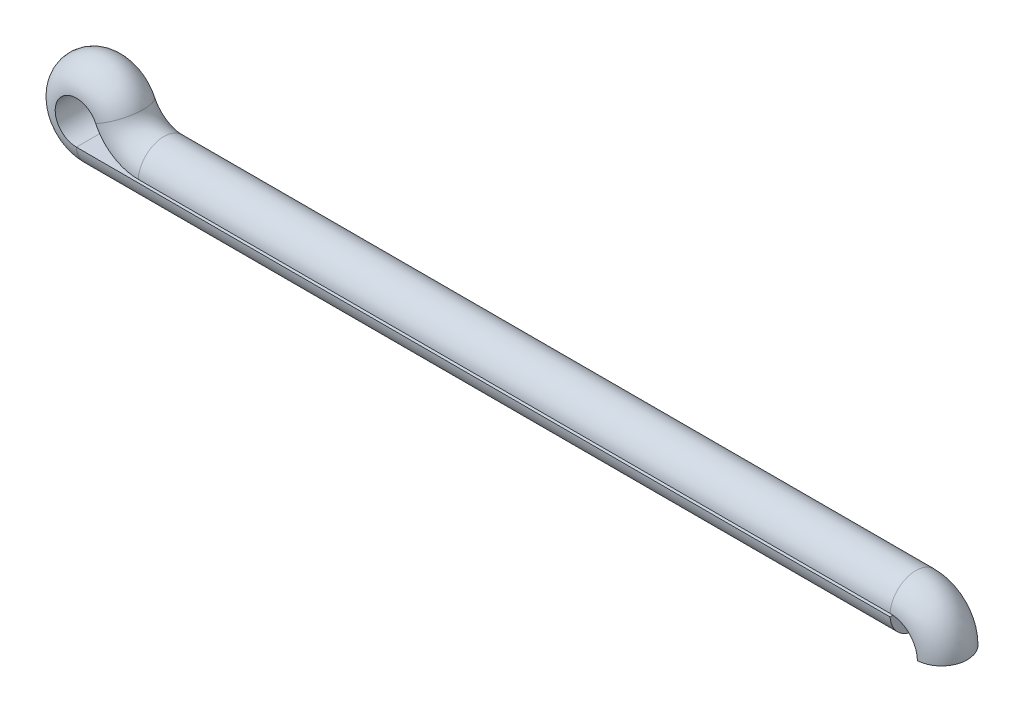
ISO-10303-21;
HEADER;
FILE_DESCRIPTION(('STEP AP214'),'2;1');
FILE_NAME('part.step','',(''),(''),'','','');
FILE_SCHEMA(('AUTOMOTIVE_DESIGN { 1 0 10303 214 1 1 1 1 }'));
ENDSEC;
DATA;
#1=APPLICATION_CONTEXT('core data for automotive mechanical design processes');
#2=APPLICATION_PROTOCOL_DEFINITION('international standard','automotive_design',2000,#1);
#3=PRODUCT_CONTEXT('',#1,'mechanical');
#4=PRODUCT('Part','Part','',(#3));
#5=PRODUCT_RELATED_PRODUCT_CATEGORY('part','',(#4));
#6=PRODUCT_DEFINITION_FORMATION('','',#4);
#7=PRODUCT_DEFINITION_CONTEXT('part definition',#1,'design');
#8=PRODUCT_DEFINITION('design','',#6,#7);
#9=PRODUCT_DEFINITION_SHAPE('','',#8);
#10=(LENGTH_UNIT() NAMED_UNIT(*) SI_UNIT(.MILLI.,.METRE.));
#11=(NAMED_UNIT(*) PLANE_ANGLE_UNIT() SI_UNIT($,.RADIAN.));
#12=(NAMED_UNIT(*) SI_UNIT($,.STERADIAN.) SOLID_ANGLE_UNIT());
#13=UNCERTAINTY_MEASURE_WITH_UNIT(LENGTH_MEASURE(1.E-05),#10,'distance_accuracy_value','');
#14=(GEOMETRIC_REPRESENTATION_CONTEXT(3) GLOBAL_UNCERTAINTY_ASSIGNED_CONTEXT((#13)) GLOBAL_UNIT_ASSIGNED_CONTEXT((#10,
#11,#12)) REPRESENTATION_CONTEXT('',''));
#15=CARTESIAN_POINT('',(0.,0.,0.));
#16=DIRECTION('',(0.,0.,1.));
#17=DIRECTION('',(1.,0.,0.));
#18=AXIS2_PLACEMENT_3D('',#15,#16,#17);
#19=CARTESIAN_POINT('',(12.6016634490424,0.,0.));
#20=DIRECTION('',(1.,0.,0.));
#21=DIRECTION('',(0.,0.,1.));
#22=AXIS2_PLACEMENT_3D('',#19,#20,#21);
#23=PLANE('',#22);
#24=CARTESIAN_POINT('',(12.6016634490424,0.,0.));
#25=DIRECTION('',(1.,0.,0.));
#26=DIRECTION('',(0.,0.,1.));
#27=AXIS2_PLACEMENT_3D('',#24,#25,#26);
#28=CIRCLE('',#27,0.4318);
#29=CARTESIAN_POINT('',(12.6016634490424,-0.0253999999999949,0.43105229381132));
#30=VERTEX_POINT('',#29);
#31=CARTESIAN_POINT('',(12.6016634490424,-0.0253999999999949,-0.43105229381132));
#32=VERTEX_POINT('',#31);
#33=EDGE_CURVE('E90',#30,#32,#28,.T.);
#34=ORIENTED_EDGE('',*,*,#33,.T.);
#35=DIRECTION('',(0.,0.,1.));
#36=VECTOR('',#35,1.);
#37=CARTESIAN_POINT('',(12.6016634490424,-0.0253999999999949,-0.43105229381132));
#38=LINE('',#37,#36);
#39=EDGE_CURVE('E99',#32,#30,#38,.T.);
#40=ORIENTED_EDGE('',*,*,#39,.T.);
#41=EDGE_LOOP('',(#34,#40));
#42=FACE_BOUND('',#41,.T.);
#43=ADVANCED_FACE('F39',(#42),#23,.T.);
#44=CARTESIAN_POINT('',(13.0334634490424,-0.431799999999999,0.));
#45=DIRECTION('',(0.,1.,0.));
#46=DIRECTION('',(0.,0.,1.));
#47=AXIS2_PLACEMENT_3D('',#44,#45,#46);
#48=PLANE('',#47);
#49=CARTESIAN_POINT('',(13.0334634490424,-0.431799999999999,0.));
#50=DIRECTION('',(0.,1.,0.));
#51=DIRECTION('',(0.,0.,1.));
#52=AXIS2_PLACEMENT_3D('',#49,#50,#51);
#53=CIRCLE('',#52,0.4318);
#54=CARTESIAN_POINT('',(13.0588634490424,-0.431799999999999,0.43105229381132));
#55=VERTEX_POINT('',#54);
#56=CARTESIAN_POINT('',(13.0588634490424,-0.431799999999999,-0.43105229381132));
#57=VERTEX_POINT('',#56);
#58=EDGE_CURVE('E53',#55,#57,#53,.T.);
#59=ORIENTED_EDGE('',*,*,#58,.F.);
#60=DIRECTION('',(0.,0.,1.));
#61=VECTOR('',#60,1.);
#62=CARTESIAN_POINT('',(13.0588634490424,-0.431799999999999,-0.43105229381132));
#63=LINE('',#62,#61);
#64=EDGE_CURVE('E11',#57,#55,#63,.T.);
#65=ORIENTED_EDGE('',*,*,#64,.F.);
#66=EDGE_LOOP('',(#59,#65));
#67=FACE_BOUND('',#66,.T.);
#68=ADVANCED_FACE('F190',(#67),#48,.F.);
#69=CARTESIAN_POINT('',(12.6016634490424,0.,0.));
#70=DIRECTION('',(-1.,0.,0.));
#71=DIRECTION('',(0.,-1.,0.));
#72=AXIS2_PLACEMENT_3D('',#69,#70,#71);
#73=CYLINDRICAL_SURFACE('',#72,0.4318);
#74=DIRECTION('',(-1.,0.,0.));
#75=VECTOR('',#74,1.);
#76=CARTESIAN_POINT('',(12.6016634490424,-0.0253999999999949,-0.43105229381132));
#77=LINE('',#76,#75);
#78=CARTESIAN_POINT('',(-1.03612076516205,-0.0253999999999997,-0.43105229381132));
#79=VERTEX_POINT('',#78);
#80=EDGE_CURVE('E97',#32,#79,#77,.T.);
#81=ORIENTED_EDGE('',*,*,#80,.F.);
#82=ORIENTED_EDGE('',*,*,#33,.F.);
#83=DIRECTION('',(-1.,0.,0.));
#84=VECTOR('',#83,1.);
#85=CARTESIAN_POINT('',(12.6016634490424,-0.0253999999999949,0.43105229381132));
#86=LINE('',#85,#84);
#87=CARTESIAN_POINT('',(-1.03612076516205,-0.0253999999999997,0.43105229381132));
#88=VERTEX_POINT('',#87);
#89=EDGE_CURVE('E95',#30,#88,#86,.T.);
#90=ORIENTED_EDGE('',*,*,#89,.T.);
#91=CARTESIAN_POINT('',(-1.03612076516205,0.,0.));
#92=DIRECTION('',(1.,0.,0.));
#93=DIRECTION('',(0.,0.,1.));
#94=AXIS2_PLACEMENT_3D('',#91,#92,#93);
#95=CIRCLE('',#94,0.4318);
#96=EDGE_CURVE('E108',#88,#79,#95,.T.);
#97=ORIENTED_EDGE('',*,*,#96,.T.);
#98=EDGE_LOOP('',(#81,#82,#90,#97));
#99=FACE_BOUND('',#98,.T.);
#100=ADVANCED_FACE('F92',(#99),#73,.T.);
#101=CARTESIAN_POINT('',(12.6016634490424,-0.0253999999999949,-0.43105229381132));
#102=DIRECTION('',(0.,-1.,0.));
#103=DIRECTION('',(1.,0.,0.));
#104=AXIS2_PLACEMENT_3D('',#101,#102,#103);
#105=PLANE('',#104);
#106=DIRECTION('',(0.,0.,1.));
#107=VECTOR('',#106,1.);
#108=CARTESIAN_POINT('',(-1.03612076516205,-0.0253999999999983,-0.43105229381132));
#109=LINE('',#108,#107);
#110=EDGE_CURVE('E106',#79,#88,#109,.T.);
#111=ORIENTED_EDGE('',*,*,#110,.T.);
#112=ORIENTED_EDGE('',*,*,#89,.F.);
#113=ORIENTED_EDGE('',*,*,#39,.F.);
#114=ORIENTED_EDGE('',*,*,#80,.T.);
#115=EDGE_LOOP('',(#111,#112,#113,#114));
#116=FACE_BOUND('',#115,.T.);
#117=ADVANCED_FACE('F104',(#116),#105,.F.);
#118=CARTESIAN_POINT('',(-1.03612076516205,0.330199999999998,0.));
#119=DIRECTION('',(0.,0.,-1.));
#120=DIRECTION('',(-1.,0.,0.));
#121=AXIS2_PLACEMENT_3D('',#118,#119,#120);
#122=DEGENERATE_TOROIDAL_SURFACE('',#121,0.330199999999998,0.4318,.T.);
#123=CARTESIAN_POINT('',(-1.03612076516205,0.330199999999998,-0.43105229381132));
#124=DIRECTION('',(0.,0.,-1.));
#125=DIRECTION('',(0.,-1.,0.));
#126=AXIS2_PLACEMENT_3D('',#123,#124,#125);
#127=CIRCLE('',#126,0.355599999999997);
#128=CARTESIAN_POINT('',(-0.713772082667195,0.480342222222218,-0.43105229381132));
#129=VERTEX_POINT('',#128);
#130=EDGE_CURVE('E116',#79,#129,#127,.T.);
#131=ORIENTED_EDGE('',*,*,#130,.F.);
#132=ORIENTED_EDGE('',*,*,#96,.F.);
#133=CARTESIAN_POINT('',(-1.03612076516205,0.330199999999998,0.43105229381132));
#134=DIRECTION('',(0.,0.,-1.));
#135=DIRECTION('',(0.,-1.,0.));
#136=AXIS2_PLACEMENT_3D('',#133,#134,#135);
#137=CIRCLE('',#136,0.355599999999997);
#138=CARTESIAN_POINT('',(-0.713772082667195,0.480342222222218,0.43105229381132));
#139=VERTEX_POINT('',#138);
#140=EDGE_CURVE('E117',#88,#139,#137,.T.);
#141=ORIENTED_EDGE('',*,*,#140,.T.);
#142=CARTESIAN_POINT('',(-0.736796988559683,0.469617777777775,0.));
#143=DIRECTION('',(-0.422222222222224,0.90649235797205,0.));
#144=DIRECTION('',(0.,0.,1.));
#145=AXIS2_PLACEMENT_3D('',#142,#143,#144);
#146=CIRCLE('',#145,0.4318);
#147=EDGE_CURVE('E113',#139,#129,#146,.T.);
#148=ORIENTED_EDGE('',*,*,#147,.T.);
#149=EDGE_LOOP('',(#131,#132,#141,#148));
#150=FACE_BOUND('',#149,.T.);
#151=ADVANCED_FACE('F170',(#150),#122,.T.);
#152=CARTESIAN_POINT('',(-1.03612076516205,0.330199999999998,0.));
#153=DIRECTION('',(0.,0.,-1.));
#154=DIRECTION('',(-1.,0.,0.));
#155=AXIS2_PLACEMENT_3D('',#152,#153,#154);
#156=CYLINDRICAL_SURFACE('',#155,0.355599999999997);
#157=DIRECTION('',(0.,0.,1.));
#158=VECTOR('',#157,1.);
#159=CARTESIAN_POINT('',(-0.713772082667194,0.480342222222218,-0.43105229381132));
#160=LINE('',#159,#158);
#161=EDGE_CURVE('E120',#129,#139,#160,.T.);
#162=ORIENTED_EDGE('',*,*,#161,.T.);
#163=ORIENTED_EDGE('',*,*,#140,.F.);
#164=ORIENTED_EDGE('',*,*,#110,.F.);
#165=ORIENTED_EDGE('',*,*,#130,.T.);
#166=EDGE_LOOP('',(#162,#163,#164,#165));
#167=FACE_BOUND('',#166,.T.);
#168=ADVANCED_FACE('F168',(#167),#156,.F.);
#169=CARTESIAN_POINT('',(0.,0.812800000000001,0.));
#170=DIRECTION('',(0.,0.,1.));
#171=DIRECTION('',(1.,0.,0.));
#172=AXIS2_PLACEMENT_3D('',#169,#170,#171);
#173=TOROIDAL_SURFACE('',#172,0.812800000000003,0.4318);
#174=CARTESIAN_POINT('',(0.,0.812800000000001,-0.43105229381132));
#175=DIRECTION('',(0.,0.,1.));
#176=DIRECTION('',(-0.906492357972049,-0.422222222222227,0.));
#177=AXIS2_PLACEMENT_3D('',#174,#175,#176);
#178=CIRCLE('',#177,0.787400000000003);
#179=CARTESIAN_POINT('',(0.,0.0253999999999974,-0.43105229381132));
#180=VERTEX_POINT('',#179);
#181=EDGE_CURVE('E126',#129,#180,#178,.T.);
#182=ORIENTED_EDGE('',*,*,#181,.F.);
#183=ORIENTED_EDGE('',*,*,#147,.F.);
#184=CARTESIAN_POINT('',(0.,0.812800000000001,0.43105229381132));
#185=DIRECTION('',(0.,0.,1.));
#186=DIRECTION('',(-0.906492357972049,-0.422222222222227,0.));
#187=AXIS2_PLACEMENT_3D('',#184,#185,#186);
#188=CIRCLE('',#187,0.787400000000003);
#189=CARTESIAN_POINT('',(0.,0.0253999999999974,0.43105229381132));
#190=VERTEX_POINT('',#189);
#191=EDGE_CURVE('E127',#139,#190,#188,.T.);
#192=ORIENTED_EDGE('',*,*,#191,.T.);
#193=CARTESIAN_POINT('',(0.,0.,0.));
#194=DIRECTION('',(-1.,0.,0.));
#195=DIRECTION('',(0.,0.,1.));
#196=AXIS2_PLACEMENT_3D('',#193,#194,#195);
#197=CIRCLE('',#196,0.4318);
#198=EDGE_CURVE('E123',#190,#180,#197,.T.);
#199=ORIENTED_EDGE('',*,*,#198,.T.);
#200=EDGE_LOOP('',(#182,#183,#192,#199));
#201=FACE_BOUND('',#200,.T.);
#202=ADVANCED_FACE('F163',(#201),#173,.T.);
#203=CARTESIAN_POINT('',(0.,0.812800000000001,0.));
#204=DIRECTION('',(0.,0.,1.));
#205=DIRECTION('',(1.,0.,0.));
#206=AXIS2_PLACEMENT_3D('',#203,#204,#205);
#207=CYLINDRICAL_SURFACE('',#206,0.787400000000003);
#208=DIRECTION('',(0.,0.,1.));
#209=VECTOR('',#208,1.);
#210=CARTESIAN_POINT('',(0.,0.0253999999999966,-0.43105229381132));
#211=LINE('',#210,#209);
#212=EDGE_CURVE('E130',#180,#190,#211,.T.);
#213=ORIENTED_EDGE('',*,*,#212,.T.);
#214=ORIENTED_EDGE('',*,*,#191,.F.);
#215=ORIENTED_EDGE('',*,*,#161,.F.);
#216=ORIENTED_EDGE('',*,*,#181,.T.);
#217=EDGE_LOOP('',(#213,#214,#215,#216));
#218=FACE_BOUND('',#217,.T.);
#219=ADVANCED_FACE('F166',(#218),#207,.T.);
#220=CARTESIAN_POINT('',(0.,0.,0.));
#221=DIRECTION('',(1.,0.,0.));
#222=DIRECTION('',(0.,1.,0.));
#223=AXIS2_PLACEMENT_3D('',#220,#221,#222);
#224=CYLINDRICAL_SURFACE('',#223,0.4318);
#225=DIRECTION('',(1.,0.,0.));
#226=VECTOR('',#225,1.);
#227=CARTESIAN_POINT('',(0.,0.0253999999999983,-0.43105229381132));
#228=LINE('',#227,#226);
#229=CARTESIAN_POINT('',(12.6016634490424,0.025399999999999,-0.43105229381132));
#230=VERTEX_POINT('',#229);
#231=EDGE_CURVE('E136',#180,#230,#228,.T.);
#232=ORIENTED_EDGE('',*,*,#231,.F.);
#233=ORIENTED_EDGE('',*,*,#198,.F.);
#234=DIRECTION('',(1.,0.,0.));
#235=VECTOR('',#234,1.);
#236=CARTESIAN_POINT('',(0.,0.0253999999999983,0.43105229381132));
#237=LINE('',#236,#235);
#238=CARTESIAN_POINT('',(12.6016634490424,0.025399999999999,0.43105229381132));
#239=VERTEX_POINT('',#238);
#240=EDGE_CURVE('E137',#190,#239,#237,.T.);
#241=ORIENTED_EDGE('',*,*,#240,.T.);
#242=CARTESIAN_POINT('',(12.6016634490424,0.,0.));
#243=DIRECTION('',(-1.,0.,0.));
#244=DIRECTION('',(0.,0.,1.));
#245=AXIS2_PLACEMENT_3D('',#242,#243,#244);
#246=CIRCLE('',#245,0.4318);
#247=EDGE_CURVE('E133',#239,#230,#246,.T.);
#248=ORIENTED_EDGE('',*,*,#247,.T.);
#249=EDGE_LOOP('',(#232,#233,#241,#248));
#250=FACE_BOUND('',#249,.T.);
#251=ADVANCED_FACE('F160',(#250),#224,.T.);
#252=CARTESIAN_POINT('',(0.,0.0253999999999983,-0.43105229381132));
#253=DIRECTION('',(0.,1.,0.));
#254=DIRECTION('',(-1.,0.,0.));
#255=AXIS2_PLACEMENT_3D('',#252,#253,#254);
#256=PLANE('',#255);
#257=DIRECTION('',(0.,0.,1.));
#258=VECTOR('',#257,1.);
#259=CARTESIAN_POINT('',(12.6016634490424,0.0253999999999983,-0.43105229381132));
#260=LINE('',#259,#258);
#261=EDGE_CURVE('E140',#230,#239,#260,.T.);
#262=ORIENTED_EDGE('',*,*,#261,.T.);
#263=ORIENTED_EDGE('',*,*,#240,.F.);
#264=ORIENTED_EDGE('',*,*,#212,.F.);
#265=ORIENTED_EDGE('',*,*,#231,.T.);
#266=EDGE_LOOP('',(#262,#263,#264,#265));
#267=FACE_BOUND('',#266,.T.);
#268=ADVANCED_FACE('F155',(#267),#256,.F.);
#269=CARTESIAN_POINT('',(12.6016634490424,-0.431799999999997,0.));
#270=DIRECTION('',(0.,0.,-1.));
#271=DIRECTION('',(-1.,0.,0.));
#272=AXIS2_PLACEMENT_3D('',#269,#270,#271);
#273=DEGENERATE_TOROIDAL_SURFACE('',#272,0.431799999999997,0.4318,.T.);
#274=CARTESIAN_POINT('',(12.6016634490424,-0.431799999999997,-0.43105229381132));
#275=DIRECTION('',(0.,0.,-1.));
#276=DIRECTION('',(0.,1.,0.));
#277=AXIS2_PLACEMENT_3D('',#274,#275,#276);
#278=CIRCLE('',#277,0.457199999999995);
#279=EDGE_CURVE('E46',#230,#57,#278,.T.);
#280=ORIENTED_EDGE('',*,*,#279,.F.);
#281=ORIENTED_EDGE('',*,*,#247,.F.);
#282=CARTESIAN_POINT('',(12.6016634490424,-0.431799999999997,0.43105229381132));
#283=DIRECTION('',(0.,0.,-1.));
#284=DIRECTION('',(0.,1.,0.));
#285=AXIS2_PLACEMENT_3D('',#282,#283,#284);
#286=CIRCLE('',#285,0.457199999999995);
#287=EDGE_CURVE('E144',#239,#55,#286,.T.);
#288=ORIENTED_EDGE('',*,*,#287,.T.);
#289=ORIENTED_EDGE('',*,*,#58,.T.);
#290=EDGE_LOOP('',(#280,#281,#288,#289));
#291=FACE_BOUND('',#290,.T.);
#292=ADVANCED_FACE('F157',(#291),#273,.T.);
#293=CARTESIAN_POINT('',(12.6016634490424,-0.431799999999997,0.));
#294=DIRECTION('',(0.,0.,-1.));
#295=DIRECTION('',(-1.,0.,0.));
#296=AXIS2_PLACEMENT_3D('',#293,#294,#295);
#297=CYLINDRICAL_SURFACE('',#296,0.457199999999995);
#298=ORIENTED_EDGE('',*,*,#64,.T.);
#299=ORIENTED_EDGE('',*,*,#287,.F.);
#300=ORIENTED_EDGE('',*,*,#261,.F.);
#301=ORIENTED_EDGE('',*,*,#279,.T.);
#302=EDGE_LOOP('',(#298,#299,#300,#301));
#303=FACE_BOUND('',#302,.T.);
#304=ADVANCED_FACE('F181',(#303),#297,.F.);
#305=CLOSED_SHELL('',(#43,#68,#100,#117,#151,#168,#202,#219,#251,#268,#292,#304));
#306=MANIFOLD_SOLID_BREP('B2',#305);
#307=ADVANCED_BREP_SHAPE_REPRESENTATION('',(#18,#306),#14);
#308=SHAPE_DEFINITION_REPRESENTATION(#9,#307);
ENDSEC;
END-ISO-10303-21;
